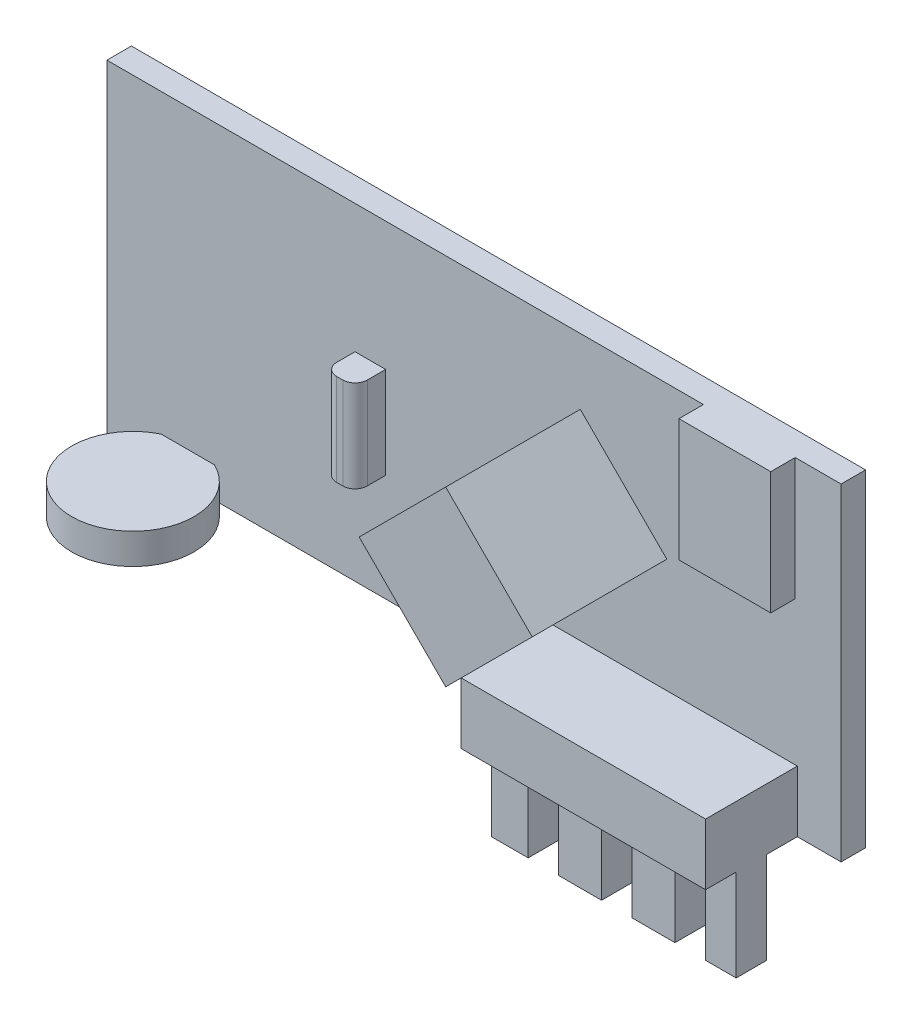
from build123d import *

# Parameters (mm, degrees)
SKETCH1_W           = 30.48
SKETCH1_H           = 13.589
BOSS_EXTRUDE1_DEPTH = 1.016
SKETCH2_W           = 3.81
SKETCH2_H           = 5.08
BOSS_EXTRUDE2_DEPTH = 1.016
BOSS_EXTRUDE3_DEPTH = 5.588
SKETCH5_W           = 10.16
SKETCH5_H           = 6.35
BOSS_EXTRUDE4_DEPTH = 3.81
SKETCH6_W           = 1.27
SKETCH6_H           = 3.81
CUT_EXTRUDE1_DEPTH  = 14.224
SKETCH7_W           = 1.27
SKETCH7_H           = 3.81
CUT_EXTRUDE2_DEPTH  = 14.224
SKETCH9_R           = 2.54
BOSS_EXTRUDE5_DEPTH = 1.27
SKETCH10_W          = 1.27
SKETCH10_H          = 3.81
BOSS_EXTRUDE6_DEPTH = 1.27
FILLET2_R           = 0.508


with BuildPart() as part:
    # Sketch1 → Boss-Extrude1 (new body)
    with BuildSketch(Plane.XY):
        with Locations((15.24, 6.7945)):
            Rectangle(SKETCH1_W, SKETCH1_H)
    extrude(amount=BOSS_EXTRUDE1_DEPTH)

    # Sketch2 → Boss-Extrude2 (add)
    with BuildSketch(Plane.XY.offset(1.016)):
        with Locations((26.67, 11.049)):
            Rectangle(SKETCH2_W, SKETCH2_H)
    extrude(amount=BOSS_EXTRUDE2_DEPTH)

    # Sketch3 → Boss-Extrude3 (add)
    with BuildSketch(Plane.XY.offset(1.016)):
        Polygon((19.653177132, 3.676184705), (23.24527958, 7.268287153), (19.653177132, 10.860389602), (16.061074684, 7.268287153), align=None)
    extrude(amount=BOSS_EXTRUDE3_DEPTH)

    # Sketch5 → Boss-Extrude4 (add)
    with BuildSketch(Plane.XY.offset(1.016)):
        with Locations((23.583686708, -0.635)):
            Rectangle(SKETCH5_W, SKETCH5_H)
    extrude(amount=BOSS_EXTRUDE4_DEPTH)

    # Sketch6 → Cut-Extrude1 (cut)
    with BuildSketch(Plane(origin=(28.663686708, 0, 0), x_dir=(0, 0, -1), z_dir=(1, 0, 0))):
        with Locations((-4.191, -1.905)):
            Rectangle(SKETCH6_W, SKETCH6_H)
        with Locations((-1.651, -1.905)):
            Rectangle(SKETCH6_W, SKETCH6_H)
    extrude(amount=-CUT_EXTRUDE1_DEPTH, mode=Mode.SUBTRACT)

    # Sketch7 → Cut-Extrude2 (cut)
    with BuildSketch(Plane.XY.offset(3.556)):
        with Locations((20.662686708, -1.905)):
            Rectangle(SKETCH7_W, SKETCH7_H)
        with Locations((23.710686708, -1.905)):
            Rectangle(SKETCH7_W, SKETCH7_H)
        with Locations((26.758686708, -1.905)):
            Rectangle(SKETCH7_W, SKETCH7_H)
    extrude(amount=-CUT_EXTRUDE2_DEPTH, mode=Mode.SUBTRACT)

    # Sketch9 → Boss-Extrude5 (add)
    with BuildSketch(Plane.XZ):
        with Locations((3.362820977, 3.302)):
            Circle(SKETCH9_R)
    extrude(amount=-BOSS_EXTRUDE5_DEPTH)

    # Sketch10 → Boss-Extrude6 (add)
    with BuildSketch(Plane.XY.offset(1.016)):
        with Locations((10.935870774, 6.35)):
            Rectangle(SKETCH10_W, SKETCH10_H)
    extrude(amount=BOSS_EXTRUDE6_DEPTH)

    # Fillet2
    fillet2_edges = [part.edges().sort_by_distance(p)[0] for p in [
        (11.570870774, 6.35, 2.286),
        (10.300870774, 6.35, 2.286),
    ]]
    fillet(fillet2_edges, radius=FILLET2_R)


solid = part.part
